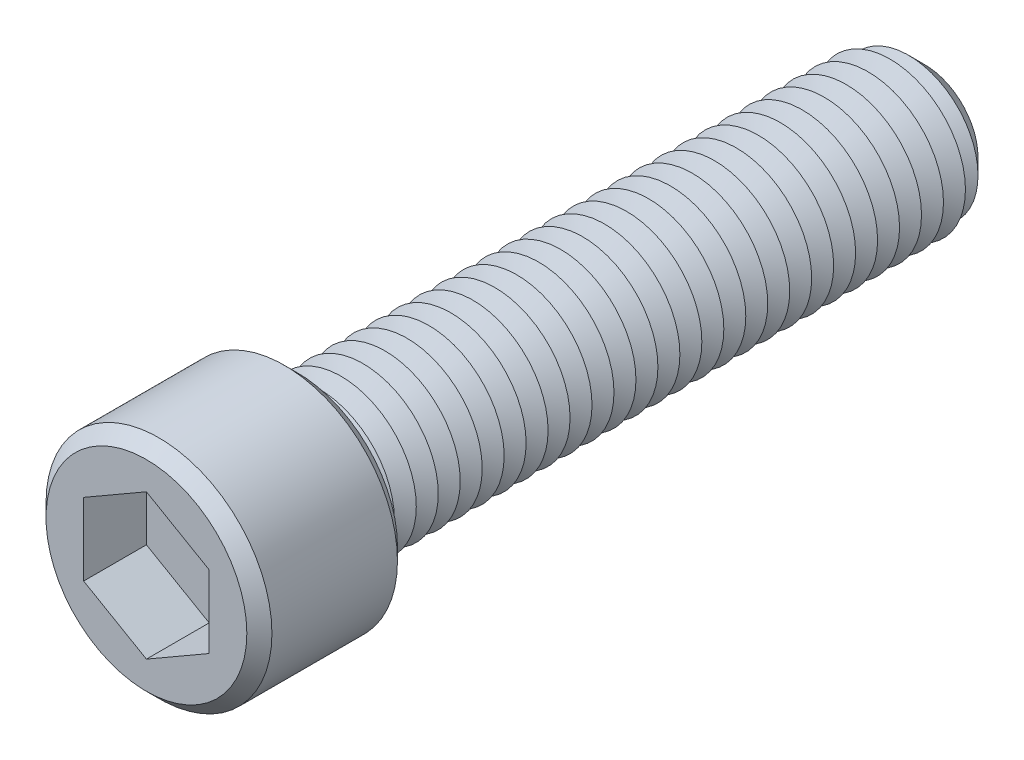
from build123d import *

# Parameters (mm, degrees)
SKETCH1_R           = 9
BOSS_EXTRUDE1_DEPTH = 12
SKETCH2_R           = 6
BOSS_EXTRUDE2_DEPTH = 50
CHAMFER1_SIZE       = 1.75
LPATTERN1_COUNT     = 28
LPATTERN1_PITCH     = 1.75
CUT_EXTRUDE1_DEPTH  = 5
SKETCH6_R           = 0.9
CUT_EXTRUDE2_DEPTH  = 57
CHAMFER2_SIZE       = 1


with BuildPart() as part:
    # Sketch1 → Boss-Extrude1 (new body)
    with BuildSketch(Plane.XY):
        Circle(SKETCH1_R)
    extrude(amount=BOSS_EXTRUDE1_DEPTH)

    # Sketch2 → Boss-Extrude2 (add)
    with BuildSketch(Plane(origin=(0, 0, 0), x_dir=(-1, 0, 0), z_dir=(0, 0, -1))):
        Circle(SKETCH2_R)
    extrude(amount=BOSS_EXTRUDE2_DEPTH)

    # Chamfer1
    chamfer1_edges = [part.edges().sort_by_distance(p)[0] for p in [
        (6, 0, -50),
    ]]
    chamfer(chamfer1_edges, length=CHAMFER1_SIZE)

    # Sketch4 → Cut-Revolve1 (revolve, cut)
    with BuildSketch(Plane(origin=(0, 0, 0), x_dir=(0, 0, -1), z_dir=(1, 0, 0)), mode=Mode.PRIVATE) as cut_revolve1_sk:
        Polygon((0, 6), (0.875, 4.484455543), (1.75, 6), align=None)
    cut_revolve1 = revolve(cut_revolve1_sk.sketch.rotate(Axis((0, 0, 2.512122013), (0, 0, -1)), 90), axis=Axis((0, 0, 2.512122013), (0, 0, -1)), mode=Mode.SUBTRACT)

    # LPattern1: Cut-Revolve1 ×28
    with Locations(*[(0, 0, -i * LPATTERN1_PITCH) for i in range(1, LPATTERN1_COUNT)]):
        add(cut_revolve1, mode=Mode.SUBTRACT)

    # Sketch5 → Cut-Extrude1 (cut)
    with BuildSketch(Plane.XY.offset(12)):
        Polygon((0, 5.773502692), (-5, 2.886751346), (-5, -2.886751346), (0, -5.773502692), (5, -2.886751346), (5, 2.886751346), align=None)
    extrude(amount=-CUT_EXTRUDE1_DEPTH, mode=Mode.SUBTRACT)

    # Sketch6 → Cut-Extrude2 (cut)
    with BuildSketch(Plane.XY.offset(7)):
        Circle(SKETCH6_R)
    extrude(amount=-CUT_EXTRUDE2_DEPTH, mode=Mode.SUBTRACT)

    # Chamfer2
    chamfer2_edges = [part.edges().sort_by_distance(p)[0] for p in [
        (-9, 0, 0),
        (-9, 0, 12),
    ]]
    chamfer(chamfer2_edges, length=CHAMFER2_SIZE)


solid = part.part
